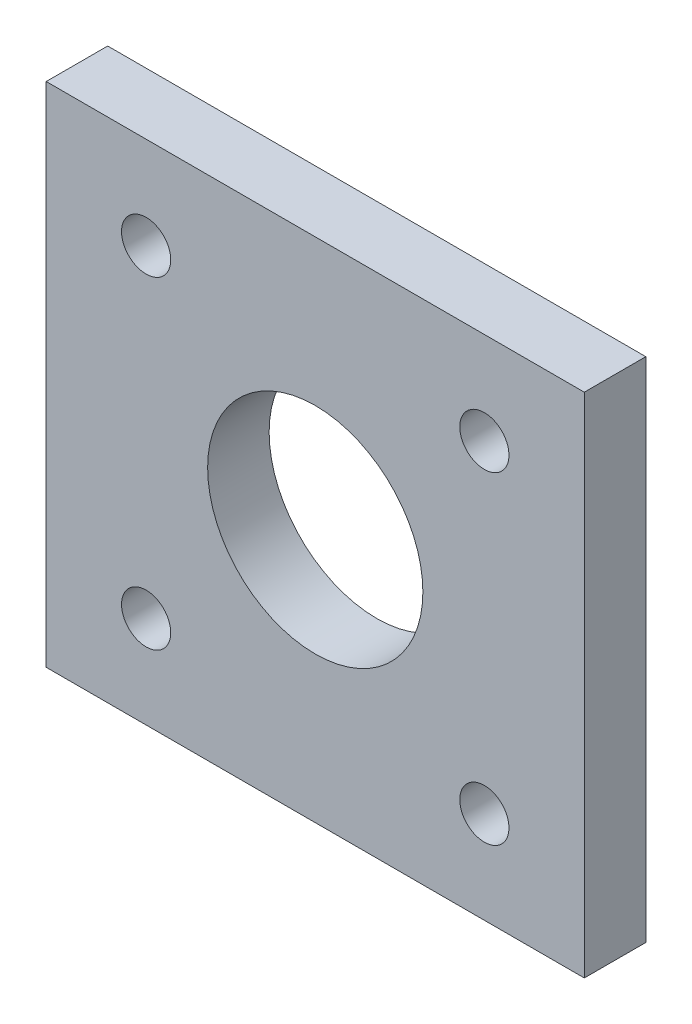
from build123d import *

# Parameters (mm, degrees)
SKETCH_1_W          = 57
SKETCH_1_H          = 55
EXTRUDE_1_DEPTH     = 4
SKETCH_5_R          = 7
SKETCH_5_R_2        = 1.6
CUT_EXTRUDE_1_DEPTH = 51.079149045
SKETCH_7_W          = 57
SKETCH_7_H          = 55
SKETCH_7_W_2        = 35
SKETCH_7_H_2        = 33
CUT_EXTRUDE_4_DEPTH = 10


with BuildPart() as part:
    # Sketch 1 → Extrude 1 (new body)
    with BuildSketch(Plane.XY):
        with Locations((2.075531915, -11.959574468)):
            Rectangle(SKETCH_1_W, SKETCH_1_H)
    extrude(amount=EXTRUDE_1_DEPTH)

    # Sketch 5 → Cut-Extrude 1 (cut, through all)
    with BuildSketch(Plane(origin=(0, 0, 0), x_dir=(-1, 0, 0), z_dir=(0, 0, -1))):
        with Locations((-2.075531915, -11.959574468)):
            Circle(SKETCH_5_R)
        with Locations((-13.075531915, -1.459574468)):
            Circle(SKETCH_5_R_2)
        with Locations((8.924468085, -1.459574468)):
            Circle(SKETCH_5_R_2)
        with Locations((8.924468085, -22.459574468)):
            Circle(SKETCH_5_R_2)
        with Locations((-13.075531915, -22.459574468)):
            Circle(SKETCH_5_R_2)
    extrude(amount=-CUT_EXTRUDE_1_DEPTH, mode=Mode.SUBTRACT)

    # Sketch 7 → Cut-Extrude 4 (cut)
    with BuildSketch(Plane.XY.offset(4)):
        with Locations((2.075531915, -11.959574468)):
            Rectangle(SKETCH_7_W, SKETCH_7_H)
        with Locations((2.075531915, -11.959574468)):
            Rectangle(SKETCH_7_W_2, SKETCH_7_H_2, mode=Mode.SUBTRACT)
    extrude(amount=-CUT_EXTRUDE_4_DEPTH, mode=Mode.SUBTRACT)


solid = part.part
